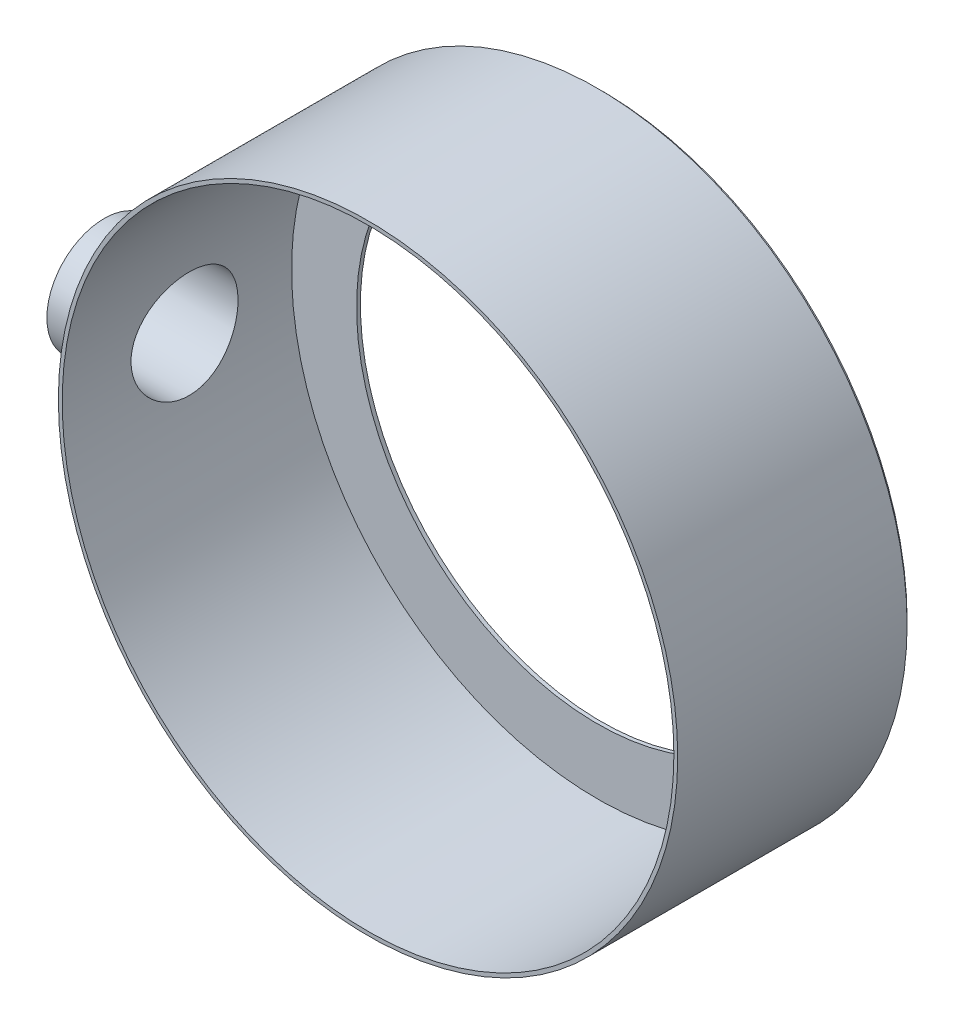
from build123d import *

# Parameters (mm, degrees)
SKETCH_1_R                       = 40
SKETCH_1_R_2                     = 31.5
EXTRUDE_1_DEPTH                  = 0.5
SKETCH_2_R                       = 40.5
SKETCH_2_R_2                     = 40
EXTRUDE_2_DEPTH                  = 30
SKETCH_3_R                       = 7
CUT_EXTRUDE_1_DEPTH              = 65.890292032
SKETCH_4_R                       = 7.5
SKETCH_4_R_2                     = 7
EXTRUDE_3_DEPTH                  = 10
EXTRUDE_3_DIRECTION_2_REACH      = 97.559
EXTRUDE_3_DIRECTION_2_END_RADIUS = 40.5


with BuildPart() as part:
    # Sketch 1 → Extrude 1 (new body)
    with BuildSketch(Plane.XY):
        Circle(SKETCH_1_R)
        Circle(SKETCH_1_R_2, mode=Mode.SUBTRACT)
    extrude(amount=EXTRUDE_1_DEPTH)


with BuildPart() as body_2:
    # Sketch 2 → Extrude 2 (new body)
    with BuildSketch(Plane.XY.offset(0.5)):
        Circle(SKETCH_2_R)
        Circle(SKETCH_2_R_2, mode=Mode.SUBTRACT)
    extrude(amount=EXTRUDE_2_DEPTH)

    # Sketch 3 → Cut-Extrude 1 (cut, through all)
    with BuildSketch(Plane(origin=(0, 0, 0), x_dir=(0, 0, -1), z_dir=(1, 0, 0))):
        with Locations((-14.5, 0)):
            Circle(SKETCH_3_R)
    extrude(amount=-CUT_EXTRUDE_1_DEPTH, mode=Mode.SUBTRACT)

    # Sketch 4 → Extrude 3 (add)
    with BuildSketch(Plane.ZY.offset(40.5)):
        with Locations((14.5, 0)):
            Circle(SKETCH_4_R)
        with Locations((14.5, 0)):
            Circle(SKETCH_4_R_2, mode=Mode.SUBTRACT)
    extrude(amount=EXTRUDE_3_DEPTH)

    # Extrude 3 direction 2: up to this cylinder (the profile starts outside it)
    extrude_3_direction_2_end = Plane(origin=(0, 0, 7.212132), z_dir=(0, 0, -1)) * Cylinder(EXTRUDE_3_DIRECTION_2_END_RADIUS, 277.118, mode=Mode.PRIVATE)
    # Sketch 4 → Extrude 3 direction 2 (add, up to the surface)
    with BuildSketch(Plane.ZY.offset(40.5), mode=Mode.PRIVATE) as extrude_3_direction_2_sk1:
        with Locations((14.5, 0)):
            Circle(SKETCH_4_R)
        with Locations((14.5, 0)):
            Circle(SKETCH_4_R_2, mode=Mode.SUBTRACT)
    extrude_3_direction_2_tool1 = extrude(extrude_3_direction_2_sk1.sketch, amount=-EXTRUDE_3_DIRECTION_2_REACH, mode=Mode.PRIVATE) - extrude_3_direction_2_end
    add(extrude_3_direction_2_tool1.solids().sort_by_distance((-40.5, 0, 7.212132))[0])
    add(extrude_3_direction_2_tool1.solids().sort_by_distance((-40.5, 0, 7.212132))[1])


solid = Compound([part.part, body_2.part])
